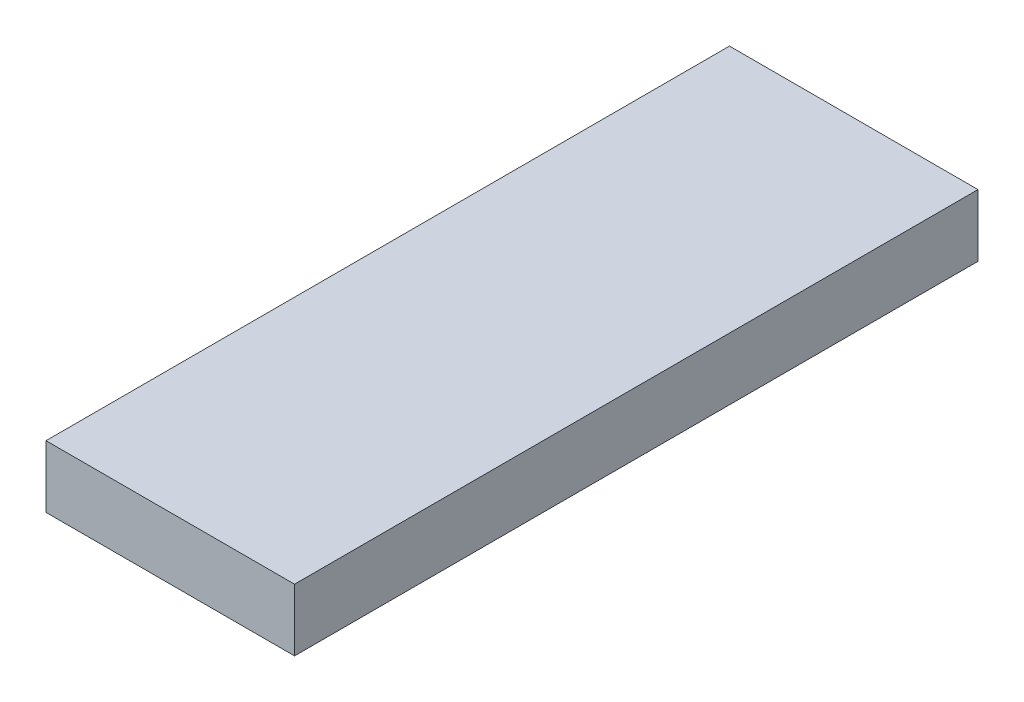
ISO-10303-21;
HEADER;
FILE_DESCRIPTION(('STEP AP214'),'2;1');
FILE_NAME('part.step','',(''),(''),'','','');
FILE_SCHEMA(('AUTOMOTIVE_DESIGN { 1 0 10303 214 1 1 1 1 }'));
ENDSEC;
DATA;
#1=APPLICATION_CONTEXT('core data for automotive mechanical design processes');
#2=APPLICATION_PROTOCOL_DEFINITION('international standard','automotive_design',2000,#1);
#3=PRODUCT_CONTEXT('',#1,'mechanical');
#4=PRODUCT('Part','Part','',(#3));
#5=PRODUCT_RELATED_PRODUCT_CATEGORY('part','',(#4));
#6=PRODUCT_DEFINITION_FORMATION('','',#4);
#7=PRODUCT_DEFINITION_CONTEXT('part definition',#1,'design');
#8=PRODUCT_DEFINITION('design','',#6,#7);
#9=PRODUCT_DEFINITION_SHAPE('','',#8);
#10=(LENGTH_UNIT() NAMED_UNIT(*) SI_UNIT(.MILLI.,.METRE.));
#11=(NAMED_UNIT(*) PLANE_ANGLE_UNIT() SI_UNIT($,.RADIAN.));
#12=(NAMED_UNIT(*) SI_UNIT($,.STERADIAN.) SOLID_ANGLE_UNIT());
#13=UNCERTAINTY_MEASURE_WITH_UNIT(LENGTH_MEASURE(1.E-05),#10,'distance_accuracy_value','');
#14=(GEOMETRIC_REPRESENTATION_CONTEXT(3) GLOBAL_UNCERTAINTY_ASSIGNED_CONTEXT((#13)) GLOBAL_UNIT_ASSIGNED_CONTEXT((#10,
#11,#12)) REPRESENTATION_CONTEXT('',''));
#15=CARTESIAN_POINT('',(0.,0.,0.));
#16=DIRECTION('',(0.,0.,1.));
#17=DIRECTION('',(1.,0.,0.));
#18=AXIS2_PLACEMENT_3D('',#15,#16,#17);
#19=CARTESIAN_POINT('',(0.,12.7,0.));
#20=DIRECTION('',(1.,0.,0.));
#21=DIRECTION('',(0.,0.,-1.));
#22=AXIS2_PLACEMENT_3D('',#19,#20,#21);
#23=PLANE('',#22);
#24=DIRECTION('',(0.,0.,1.));
#25=VECTOR('',#24,1.);
#26=CARTESIAN_POINT('',(0.,0.,0.));
#27=LINE('',#26,#25);
#28=CARTESIAN_POINT('',(0.,0.,-139.7));
#29=VERTEX_POINT('',#28);
#30=CARTESIAN_POINT('',(0.,0.,0.));
#31=VERTEX_POINT('',#30);
#32=EDGE_CURVE('E95',#29,#31,#27,.T.);
#33=ORIENTED_EDGE('',*,*,#32,.T.);
#34=DIRECTION('',(0.,-1.,0.));
#35=VECTOR('',#34,1.);
#36=CARTESIAN_POINT('',(0.,12.7,0.));
#37=LINE('',#36,#35);
#38=CARTESIAN_POINT('',(0.,12.7,0.));
#39=VERTEX_POINT('',#38);
#40=EDGE_CURVE('E11',#39,#31,#37,.T.);
#41=ORIENTED_EDGE('',*,*,#40,.F.);
#42=DIRECTION('',(0.,0.,1.));
#43=VECTOR('',#42,1.);
#44=CARTESIAN_POINT('',(0.,12.7,0.));
#45=LINE('',#44,#43);
#46=CARTESIAN_POINT('',(0.,12.7,-139.7));
#47=VERTEX_POINT('',#46);
#48=EDGE_CURVE('E83',#47,#39,#45,.T.);
#49=ORIENTED_EDGE('',*,*,#48,.F.);
#50=DIRECTION('',(0.,-1.,0.));
#51=VECTOR('',#50,1.);
#52=CARTESIAN_POINT('',(0.,12.7,-139.7));
#53=LINE('',#52,#51);
#54=EDGE_CURVE('E91',#47,#29,#53,.T.);
#55=ORIENTED_EDGE('',*,*,#54,.T.);
#56=EDGE_LOOP('',(#33,#41,#49,#55));
#57=FACE_BOUND('',#56,.T.);
#58=ADVANCED_FACE('F32',(#57),#23,.F.);
#59=CARTESIAN_POINT('',(0.,12.7,0.));
#60=DIRECTION('',(0.,0.,-1.));
#61=DIRECTION('',(-1.,0.,0.));
#62=AXIS2_PLACEMENT_3D('',#59,#60,#61);
#63=PLANE('',#62);
#64=DIRECTION('',(1.,0.,0.));
#65=VECTOR('',#64,1.);
#66=CARTESIAN_POINT('',(0.,0.,0.));
#67=LINE('',#66,#65);
#68=CARTESIAN_POINT('',(50.8,0.,0.));
#69=VERTEX_POINT('',#68);
#70=EDGE_CURVE('E87',#31,#69,#67,.T.);
#71=ORIENTED_EDGE('',*,*,#70,.T.);
#72=DIRECTION('',(0.,-1.,0.));
#73=VECTOR('',#72,1.);
#74=CARTESIAN_POINT('',(50.8,12.7,0.));
#75=LINE('',#74,#73);
#76=CARTESIAN_POINT('',(50.8,12.7,0.));
#77=VERTEX_POINT('',#76);
#78=EDGE_CURVE('E40',#77,#69,#75,.T.);
#79=ORIENTED_EDGE('',*,*,#78,.F.);
#80=DIRECTION('',(1.,0.,0.));
#81=VECTOR('',#80,1.);
#82=CARTESIAN_POINT('',(0.,12.7,0.));
#83=LINE('',#82,#81);
#84=EDGE_CURVE('E78',#39,#77,#83,.T.);
#85=ORIENTED_EDGE('',*,*,#84,.F.);
#86=ORIENTED_EDGE('',*,*,#40,.T.);
#87=EDGE_LOOP('',(#71,#79,#85,#86));
#88=FACE_BOUND('',#87,.T.);
#89=ADVANCED_FACE('F86',(#88),#63,.F.);
#90=CARTESIAN_POINT('',(50.8,12.7,0.));
#91=DIRECTION('',(-1.,0.,0.));
#92=DIRECTION('',(0.,0.,1.));
#93=AXIS2_PLACEMENT_3D('',#90,#91,#92);
#94=PLANE('',#93);
#95=DIRECTION('',(0.,0.,-1.));
#96=VECTOR('',#95,1.);
#97=CARTESIAN_POINT('',(50.8,0.,0.));
#98=LINE('',#97,#96);
#99=CARTESIAN_POINT('',(50.8,0.,-139.7));
#100=VERTEX_POINT('',#99);
#101=EDGE_CURVE('E65',#69,#100,#98,.T.);
#102=ORIENTED_EDGE('',*,*,#101,.T.);
#103=DIRECTION('',(0.,-1.,0.));
#104=VECTOR('',#103,1.);
#105=CARTESIAN_POINT('',(50.8,12.7,-139.7));
#106=LINE('',#105,#104);
#107=CARTESIAN_POINT('',(50.8,12.7,-139.7));
#108=VERTEX_POINT('',#107);
#109=EDGE_CURVE('E88',#108,#100,#106,.T.);
#110=ORIENTED_EDGE('',*,*,#109,.F.);
#111=DIRECTION('',(0.,0.,-1.));
#112=VECTOR('',#111,1.);
#113=CARTESIAN_POINT('',(50.8,12.7,0.));
#114=LINE('',#113,#112);
#115=EDGE_CURVE('E81',#77,#108,#114,.T.);
#116=ORIENTED_EDGE('',*,*,#115,.F.);
#117=ORIENTED_EDGE('',*,*,#78,.T.);
#118=EDGE_LOOP('',(#102,#110,#116,#117));
#119=FACE_BOUND('',#118,.T.);
#120=ADVANCED_FACE('F89',(#119),#94,.F.);
#121=CARTESIAN_POINT('',(0.,12.7,-139.7));
#122=DIRECTION('',(0.,0.,1.));
#123=DIRECTION('',(1.,0.,0.));
#124=AXIS2_PLACEMENT_3D('',#121,#122,#123);
#125=PLANE('',#124);
#126=DIRECTION('',(-1.,0.,0.));
#127=VECTOR('',#126,1.);
#128=CARTESIAN_POINT('',(0.,0.,-139.7));
#129=LINE('',#128,#127);
#130=EDGE_CURVE('E71',#100,#29,#129,.T.);
#131=ORIENTED_EDGE('',*,*,#130,.T.);
#132=ORIENTED_EDGE('',*,*,#54,.F.);
#133=DIRECTION('',(-1.,0.,0.));
#134=VECTOR('',#133,1.);
#135=CARTESIAN_POINT('',(0.,12.7,-139.7));
#136=LINE('',#135,#134);
#137=EDGE_CURVE('E48',#108,#47,#136,.T.);
#138=ORIENTED_EDGE('',*,*,#137,.F.);
#139=ORIENTED_EDGE('',*,*,#109,.T.);
#140=EDGE_LOOP('',(#131,#132,#138,#139));
#141=FACE_BOUND('',#140,.T.);
#142=ADVANCED_FACE('F102',(#141),#125,.F.);
#143=CARTESIAN_POINT('',(0.,12.7,0.));
#144=DIRECTION('',(0.,-1.,0.));
#145=DIRECTION('',(0.,0.,-1.));
#146=AXIS2_PLACEMENT_3D('',#143,#144,#145);
#147=PLANE('',#146);
#148=ORIENTED_EDGE('',*,*,#48,.T.);
#149=ORIENTED_EDGE('',*,*,#84,.T.);
#150=ORIENTED_EDGE('',*,*,#115,.T.);
#151=ORIENTED_EDGE('',*,*,#137,.T.);
#152=EDGE_LOOP('',(#148,#149,#150,#151));
#153=FACE_BOUND('',#152,.T.);
#154=ADVANCED_FACE('F79',(#153),#147,.F.);
#155=CARTESIAN_POINT('',(0.,0.,0.));
#156=DIRECTION('',(0.,-1.,0.));
#157=DIRECTION('',(0.,0.,-1.));
#158=AXIS2_PLACEMENT_3D('',#155,#156,#157);
#159=PLANE('',#158);
#160=ORIENTED_EDGE('',*,*,#32,.F.);
#161=ORIENTED_EDGE('',*,*,#130,.F.);
#162=ORIENTED_EDGE('',*,*,#101,.F.);
#163=ORIENTED_EDGE('',*,*,#70,.F.);
#164=EDGE_LOOP('',(#160,#161,#162,#163));
#165=FACE_BOUND('',#164,.T.);
#166=ADVANCED_FACE('F105',(#165),#159,.T.);
#167=CLOSED_SHELL('',(#58,#89,#120,#142,#154,#166));
#168=MANIFOLD_SOLID_BREP('B2',#167);
#169=ADVANCED_BREP_SHAPE_REPRESENTATION('',(#18,#168),#14);
#170=SHAPE_DEFINITION_REPRESENTATION(#9,#169);
ENDSEC;
END-ISO-10303-21;
